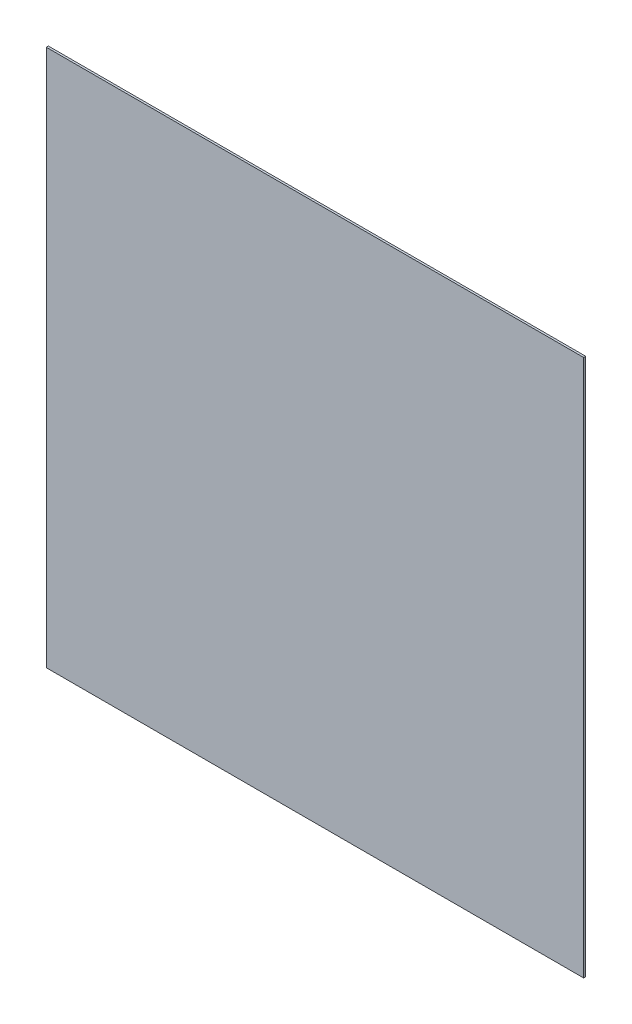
ISO-10303-21;
HEADER;
FILE_DESCRIPTION(('STEP AP214'),'2;1');
FILE_NAME('part.step','',(''),(''),'','','');
FILE_SCHEMA(('AUTOMOTIVE_DESIGN { 1 0 10303 214 1 1 1 1 }'));
ENDSEC;
DATA;
#1=APPLICATION_CONTEXT('core data for automotive mechanical design processes');
#2=APPLICATION_PROTOCOL_DEFINITION('international standard','automotive_design',2000,#1);
#3=PRODUCT_CONTEXT('',#1,'mechanical');
#4=PRODUCT('Part','Part','',(#3));
#5=PRODUCT_RELATED_PRODUCT_CATEGORY('part','',(#4));
#6=PRODUCT_DEFINITION_FORMATION('','',#4);
#7=PRODUCT_DEFINITION_CONTEXT('part definition',#1,'design');
#8=PRODUCT_DEFINITION('design','',#6,#7);
#9=PRODUCT_DEFINITION_SHAPE('','',#8);
#10=(LENGTH_UNIT() NAMED_UNIT(*) SI_UNIT(.MILLI.,.METRE.));
#11=(NAMED_UNIT(*) PLANE_ANGLE_UNIT() SI_UNIT($,.RADIAN.));
#12=(NAMED_UNIT(*) SI_UNIT($,.STERADIAN.) SOLID_ANGLE_UNIT());
#13=UNCERTAINTY_MEASURE_WITH_UNIT(LENGTH_MEASURE(1.E-05),#10,'distance_accuracy_value','');
#14=(GEOMETRIC_REPRESENTATION_CONTEXT(3) GLOBAL_UNCERTAINTY_ASSIGNED_CONTEXT((#13)) GLOBAL_UNIT_ASSIGNED_CONTEXT((#10,
#11,#12)) REPRESENTATION_CONTEXT('',''));
#15=CARTESIAN_POINT('',(0.,0.,0.));
#16=DIRECTION('',(0.,0.,1.));
#17=DIRECTION('',(1.,0.,0.));
#18=AXIS2_PLACEMENT_3D('',#15,#16,#17);
#19=CARTESIAN_POINT('',(412.75,-412.75,1.5875));
#20=DIRECTION('',(-1.,0.,0.));
#21=DIRECTION('',(0.,0.,1.));
#22=AXIS2_PLACEMENT_3D('',#19,#20,#21);
#23=PLANE('',#22);
#24=DIRECTION('',(0.,1.,0.));
#25=VECTOR('',#24,1.);
#26=CARTESIAN_POINT('',(412.75,-412.75,-1.5875));
#27=LINE('',#26,#25);
#28=CARTESIAN_POINT('',(412.75,-412.75,-1.5875));
#29=VERTEX_POINT('',#28);
#30=CARTESIAN_POINT('',(412.75,412.75,-1.5875));
#31=VERTEX_POINT('',#30);
#32=EDGE_CURVE('E93',#29,#31,#27,.T.);
#33=ORIENTED_EDGE('',*,*,#32,.T.);
#34=DIRECTION('',(0.,0.,-1.));
#35=VECTOR('',#34,1.);
#36=CARTESIAN_POINT('',(412.75,412.75,1.5875));
#37=LINE('',#36,#35);
#38=CARTESIAN_POINT('',(412.75,412.75,1.5875));
#39=VERTEX_POINT('',#38);
#40=EDGE_CURVE('E11',#39,#31,#37,.T.);
#41=ORIENTED_EDGE('',*,*,#40,.F.);
#42=DIRECTION('',(0.,1.,0.));
#43=VECTOR('',#42,1.);
#44=CARTESIAN_POINT('',(412.75,-412.75,1.5875));
#45=LINE('',#44,#43);
#46=CARTESIAN_POINT('',(412.75,-412.75,1.5875));
#47=VERTEX_POINT('',#46);
#48=EDGE_CURVE('E81',#47,#39,#45,.T.);
#49=ORIENTED_EDGE('',*,*,#48,.F.);
#50=DIRECTION('',(0.,0.,-1.));
#51=VECTOR('',#50,1.);
#52=CARTESIAN_POINT('',(412.75,-412.75,1.5875));
#53=LINE('',#52,#51);
#54=EDGE_CURVE('E89',#47,#29,#53,.T.);
#55=ORIENTED_EDGE('',*,*,#54,.T.);
#56=EDGE_LOOP('',(#33,#41,#49,#55));
#57=FACE_BOUND('',#56,.T.);
#58=ADVANCED_FACE('F30',(#57),#23,.F.);
#59=CARTESIAN_POINT('',(-412.75,412.75,1.5875));
#60=DIRECTION('',(0.,-1.,0.));
#61=DIRECTION('',(0.,0.,-1.));
#62=AXIS2_PLACEMENT_3D('',#59,#60,#61);
#63=PLANE('',#62);
#64=DIRECTION('',(-1.,0.,0.));
#65=VECTOR('',#64,1.);
#66=CARTESIAN_POINT('',(-412.75,412.75,-1.5875));
#67=LINE('',#66,#65);
#68=CARTESIAN_POINT('',(-412.75,412.75,-1.5875));
#69=VERTEX_POINT('',#68);
#70=EDGE_CURVE('E85',#31,#69,#67,.T.);
#71=ORIENTED_EDGE('',*,*,#70,.T.);
#72=DIRECTION('',(0.,0.,-1.));
#73=VECTOR('',#72,1.);
#74=CARTESIAN_POINT('',(-412.75,412.75,1.5875));
#75=LINE('',#74,#73);
#76=CARTESIAN_POINT('',(-412.75,412.75,1.5875));
#77=VERTEX_POINT('',#76);
#78=EDGE_CURVE('E38',#77,#69,#75,.T.);
#79=ORIENTED_EDGE('',*,*,#78,.F.);
#80=DIRECTION('',(-1.,0.,0.));
#81=VECTOR('',#80,1.);
#82=CARTESIAN_POINT('',(-412.75,412.75,1.5875));
#83=LINE('',#82,#81);
#84=EDGE_CURVE('E76',#39,#77,#83,.T.);
#85=ORIENTED_EDGE('',*,*,#84,.F.);
#86=ORIENTED_EDGE('',*,*,#40,.T.);
#87=EDGE_LOOP('',(#71,#79,#85,#86));
#88=FACE_BOUND('',#87,.T.);
#89=ADVANCED_FACE('F84',(#88),#63,.F.);
#90=CARTESIAN_POINT('',(-412.75,-412.75,1.5875));
#91=DIRECTION('',(1.,0.,0.));
#92=DIRECTION('',(0.,0.,-1.));
#93=AXIS2_PLACEMENT_3D('',#90,#91,#92);
#94=PLANE('',#93);
#95=DIRECTION('',(0.,-1.,0.));
#96=VECTOR('',#95,1.);
#97=CARTESIAN_POINT('',(-412.75,-412.75,-1.5875));
#98=LINE('',#97,#96);
#99=CARTESIAN_POINT('',(-412.75,-412.75,-1.5875));
#100=VERTEX_POINT('',#99);
#101=EDGE_CURVE('E63',#69,#100,#98,.T.);
#102=ORIENTED_EDGE('',*,*,#101,.T.);
#103=DIRECTION('',(0.,0.,-1.));
#104=VECTOR('',#103,1.);
#105=CARTESIAN_POINT('',(-412.75,-412.75,1.5875));
#106=LINE('',#105,#104);
#107=CARTESIAN_POINT('',(-412.75,-412.75,1.5875));
#108=VERTEX_POINT('',#107);
#109=EDGE_CURVE('E86',#108,#100,#106,.T.);
#110=ORIENTED_EDGE('',*,*,#109,.F.);
#111=DIRECTION('',(0.,-1.,0.));
#112=VECTOR('',#111,1.);
#113=CARTESIAN_POINT('',(-412.75,-412.75,1.5875));
#114=LINE('',#113,#112);
#115=EDGE_CURVE('E79',#77,#108,#114,.T.);
#116=ORIENTED_EDGE('',*,*,#115,.F.);
#117=ORIENTED_EDGE('',*,*,#78,.T.);
#118=EDGE_LOOP('',(#102,#110,#116,#117));
#119=FACE_BOUND('',#118,.T.);
#120=ADVANCED_FACE('F87',(#119),#94,.F.);
#121=CARTESIAN_POINT('',(-412.75,-412.75,1.5875));
#122=DIRECTION('',(0.,1.,0.));
#123=DIRECTION('',(0.,0.,1.));
#124=AXIS2_PLACEMENT_3D('',#121,#122,#123);
#125=PLANE('',#124);
#126=DIRECTION('',(1.,0.,0.));
#127=VECTOR('',#126,1.);
#128=CARTESIAN_POINT('',(-412.75,-412.75,-1.5875));
#129=LINE('',#128,#127);
#130=EDGE_CURVE('E69',#100,#29,#129,.T.);
#131=ORIENTED_EDGE('',*,*,#130,.T.);
#132=ORIENTED_EDGE('',*,*,#54,.F.);
#133=DIRECTION('',(1.,0.,0.));
#134=VECTOR('',#133,1.);
#135=CARTESIAN_POINT('',(-412.75,-412.75,1.5875));
#136=LINE('',#135,#134);
#137=EDGE_CURVE('E46',#108,#47,#136,.T.);
#138=ORIENTED_EDGE('',*,*,#137,.F.);
#139=ORIENTED_EDGE('',*,*,#109,.T.);
#140=EDGE_LOOP('',(#131,#132,#138,#139));
#141=FACE_BOUND('',#140,.T.);
#142=ADVANCED_FACE('F100',(#141),#125,.F.);
#143=CARTESIAN_POINT('',(412.75,412.75,1.5875));
#144=DIRECTION('',(0.,0.,-1.));
#145=DIRECTION('',(-1.,0.,0.));
#146=AXIS2_PLACEMENT_3D('',#143,#144,#145);
#147=PLANE('',#146);
#148=ORIENTED_EDGE('',*,*,#48,.T.);
#149=ORIENTED_EDGE('',*,*,#84,.T.);
#150=ORIENTED_EDGE('',*,*,#115,.T.);
#151=ORIENTED_EDGE('',*,*,#137,.T.);
#152=EDGE_LOOP('',(#148,#149,#150,#151));
#153=FACE_BOUND('',#152,.T.);
#154=ADVANCED_FACE('F77',(#153),#147,.F.);
#155=CARTESIAN_POINT('',(412.75,412.75,-1.5875));
#156=DIRECTION('',(0.,0.,-1.));
#157=DIRECTION('',(-1.,0.,0.));
#158=AXIS2_PLACEMENT_3D('',#155,#156,#157);
#159=PLANE('',#158);
#160=ORIENTED_EDGE('',*,*,#32,.F.);
#161=ORIENTED_EDGE('',*,*,#130,.F.);
#162=ORIENTED_EDGE('',*,*,#101,.F.);
#163=ORIENTED_EDGE('',*,*,#70,.F.);
#164=EDGE_LOOP('',(#160,#161,#162,#163));
#165=FACE_BOUND('',#164,.T.);
#166=ADVANCED_FACE('F103',(#165),#159,.T.);
#167=CLOSED_SHELL('',(#58,#89,#120,#142,#154,#166));
#168=MANIFOLD_SOLID_BREP('B2',#167);
#169=ADVANCED_BREP_SHAPE_REPRESENTATION('',(#18,#168),#14);
#170=SHAPE_DEFINITION_REPRESENTATION(#9,#169);
ENDSEC;
END-ISO-10303-21;
